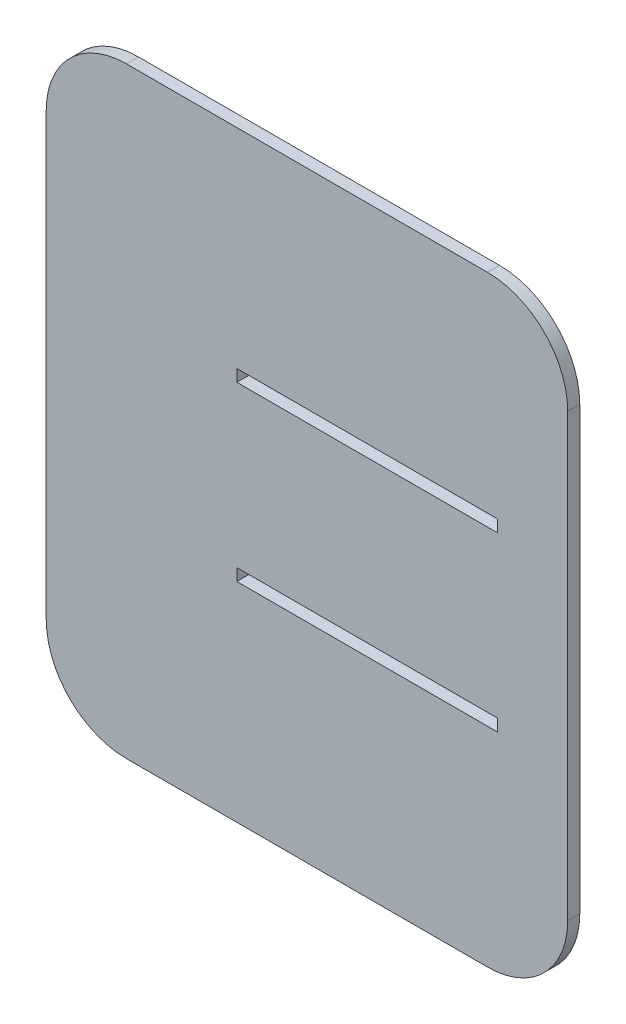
ISO-10303-21;
HEADER;
FILE_DESCRIPTION(('STEP AP214'),'2;1');
FILE_NAME('part.step','',(''),(''),'','','');
FILE_SCHEMA(('AUTOMOTIVE_DESIGN { 1 0 10303 214 1 1 1 1 }'));
ENDSEC;
DATA;
#1=APPLICATION_CONTEXT('core data for automotive mechanical design processes');
#2=APPLICATION_PROTOCOL_DEFINITION('international standard','automotive_design',2000,#1);
#3=PRODUCT_CONTEXT('',#1,'mechanical');
#4=PRODUCT('Part','Part','',(#3));
#5=PRODUCT_RELATED_PRODUCT_CATEGORY('part','',(#4));
#6=PRODUCT_DEFINITION_FORMATION('','',#4);
#7=PRODUCT_DEFINITION_CONTEXT('part definition',#1,'design');
#8=PRODUCT_DEFINITION('design','',#6,#7);
#9=PRODUCT_DEFINITION_SHAPE('','',#8);
#10=(LENGTH_UNIT() NAMED_UNIT(*) SI_UNIT(.MILLI.,.METRE.));
#11=(NAMED_UNIT(*) PLANE_ANGLE_UNIT() SI_UNIT($,.RADIAN.));
#12=(NAMED_UNIT(*) SI_UNIT($,.STERADIAN.) SOLID_ANGLE_UNIT());
#13=UNCERTAINTY_MEASURE_WITH_UNIT(LENGTH_MEASURE(1.E-05),#10,'distance_accuracy_value','');
#14=(GEOMETRIC_REPRESENTATION_CONTEXT(3) GLOBAL_UNCERTAINTY_ASSIGNED_CONTEXT((#13)) GLOBAL_UNIT_ASSIGNED_CONTEXT((#10,
#11,#12)) REPRESENTATION_CONTEXT('',''));
#15=CARTESIAN_POINT('',(0.,0.,0.));
#16=DIRECTION('',(0.,0.,1.));
#17=DIRECTION('',(1.,0.,0.));
#18=AXIS2_PLACEMENT_3D('',#15,#16,#17);
#19=CARTESIAN_POINT('',(-5.64089222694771,-41.0894941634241,3.));
#20=DIRECTION('',(0.,0.,-1.));
#21=DIRECTION('',(-1.,0.,0.));
#22=AXIS2_PLACEMENT_3D('',#19,#20,#21);
#23=PLANE('',#22);
#24=DIRECTION('',(0.,-1.,0.));
#25=VECTOR('',#24,1.);
#26=CARTESIAN_POINT('',(21.8591077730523,-6.08949416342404,3.));
#27=LINE('',#26,#25);
#28=CARTESIAN_POINT('',(21.8591077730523,-6.08949416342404,3.));
#29=VERTEX_POINT('',#28);
#30=CARTESIAN_POINT('',(21.8591077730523,-9.08949416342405,3.));
#31=VERTEX_POINT('',#30);
#32=EDGE_CURVE('E182',#29,#31,#27,.T.);
#33=ORIENTED_EDGE('',*,*,#32,.F.);
#34=DIRECTION('',(-1.,0.,0.));
#35=VECTOR('',#34,1.);
#36=CARTESIAN_POINT('',(21.8591077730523,-6.08949416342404,3.));
#37=LINE('',#36,#35);
#38=CARTESIAN_POINT('',(86.8591077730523,-6.08949416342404,3.));
#39=VERTEX_POINT('',#38);
#40=EDGE_CURVE('E190',#39,#29,#37,.T.);
#41=ORIENTED_EDGE('',*,*,#40,.F.);
#42=DIRECTION('',(0.,1.,0.));
#43=VECTOR('',#42,1.);
#44=CARTESIAN_POINT('',(86.8591077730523,-6.08949416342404,3.));
#45=LINE('',#44,#43);
#46=CARTESIAN_POINT('',(86.8591077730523,-9.08949416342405,3.));
#47=VERTEX_POINT('',#46);
#48=EDGE_CURVE('E187',#47,#39,#45,.T.);
#49=ORIENTED_EDGE('',*,*,#48,.F.);
#50=DIRECTION('',(1.,0.,0.));
#51=VECTOR('',#50,1.);
#52=CARTESIAN_POINT('',(21.8591077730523,-9.08949416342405,3.));
#53=LINE('',#52,#51);
#54=EDGE_CURVE('E184',#31,#47,#53,.T.);
#55=ORIENTED_EDGE('',*,*,#54,.F.);
#56=EDGE_LOOP('',(#33,#41,#49,#55));
#57=FACE_BOUND('',#56,.T.);
#58=CARTESIAN_POINT('',(-5.64089222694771,-41.0894941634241,3.));
#59=DIRECTION('',(0.,0.,1.));
#60=DIRECTION('',(-1.,0.,0.));
#61=AXIS2_PLACEMENT_3D('',#58,#59,#60);
#62=CIRCLE('',#61,20.);
#63=CARTESIAN_POINT('',(-25.6408922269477,-41.0894941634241,3.));
#64=VERTEX_POINT('',#63);
#65=CARTESIAN_POINT('',(-5.6408922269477,-61.0894941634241,3.));
#66=VERTEX_POINT('',#65);
#67=EDGE_CURVE('E213',#64,#66,#62,.T.);
#68=ORIENTED_EDGE('',*,*,#67,.T.);
#69=DIRECTION('',(1.,0.,0.));
#70=VECTOR('',#69,1.);
#71=CARTESIAN_POINT('',(-5.6408922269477,-61.0894941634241,3.));
#72=LINE('',#71,#70);
#73=CARTESIAN_POINT('',(84.3591077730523,-61.089494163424,3.));
#74=VERTEX_POINT('',#73);
#75=EDGE_CURVE('E216',#66,#74,#72,.T.);
#76=ORIENTED_EDGE('',*,*,#75,.T.);
#77=CARTESIAN_POINT('',(84.3591077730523,-41.089494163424,3.));
#78=DIRECTION('',(0.,0.,1.));
#79=DIRECTION('',(1.,0.,0.));
#80=AXIS2_PLACEMENT_3D('',#77,#78,#79);
#81=CIRCLE('',#80,20.);
#82=CARTESIAN_POINT('',(104.359107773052,-41.089494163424,3.));
#83=VERTEX_POINT('',#82);
#84=EDGE_CURVE('E219',#74,#83,#81,.T.);
#85=ORIENTED_EDGE('',*,*,#84,.T.);
#86=DIRECTION('',(0.,1.,0.));
#87=VECTOR('',#86,1.);
#88=CARTESIAN_POINT('',(104.359107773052,68.9105058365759,3.));
#89=LINE('',#88,#87);
#90=CARTESIAN_POINT('',(104.359107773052,68.9105058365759,3.));
#91=VERTEX_POINT('',#90);
#92=EDGE_CURVE('E221',#83,#91,#89,.T.);
#93=ORIENTED_EDGE('',*,*,#92,.T.);
#94=CARTESIAN_POINT('',(84.3591077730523,68.9105058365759,3.));
#95=DIRECTION('',(0.,0.,1.));
#96=DIRECTION('',(1.,0.,0.));
#97=AXIS2_PLACEMENT_3D('',#94,#95,#96);
#98=CIRCLE('',#97,20.);
#99=CARTESIAN_POINT('',(84.3591077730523,88.9105058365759,3.));
#100=VERTEX_POINT('',#99);
#101=EDGE_CURVE('E223',#91,#100,#98,.T.);
#102=ORIENTED_EDGE('',*,*,#101,.T.);
#103=DIRECTION('',(-1.,0.,0.));
#104=VECTOR('',#103,1.);
#105=CARTESIAN_POINT('',(-5.64089222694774,88.9105058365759,3.));
#106=LINE('',#105,#104);
#107=CARTESIAN_POINT('',(-5.64089222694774,88.9105058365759,3.));
#108=VERTEX_POINT('',#107);
#109=EDGE_CURVE('E225',#100,#108,#106,.T.);
#110=ORIENTED_EDGE('',*,*,#109,.T.);
#111=CARTESIAN_POINT('',(-5.64089222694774,68.9105058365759,3.));
#112=DIRECTION('',(0.,0.,1.));
#113=DIRECTION('',(-1.,0.,0.));
#114=AXIS2_PLACEMENT_3D('',#111,#112,#113);
#115=CIRCLE('',#114,20.);
#116=CARTESIAN_POINT('',(-25.6408922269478,68.9105058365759,3.));
#117=VERTEX_POINT('',#116);
#118=EDGE_CURVE('E227',#108,#117,#115,.T.);
#119=ORIENTED_EDGE('',*,*,#118,.T.);
#120=DIRECTION('',(0.,-1.,0.));
#121=VECTOR('',#120,1.);
#122=CARTESIAN_POINT('',(-25.6408922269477,68.9105058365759,3.));
#123=LINE('',#122,#121);
#124=EDGE_CURVE('E229',#117,#64,#123,.T.);
#125=ORIENTED_EDGE('',*,*,#124,.T.);
#126=EDGE_LOOP('',(#68,#76,#85,#93,#102,#110,#119,#125));
#127=FACE_BOUND('',#126,.T.);
#128=DIRECTION('',(1.,0.,0.));
#129=VECTOR('',#128,1.);
#130=CARTESIAN_POINT('',(21.8591077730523,33.9105058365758,3.));
#131=LINE('',#130,#129);
#132=CARTESIAN_POINT('',(21.8591077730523,33.9105058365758,3.));
#133=VERTEX_POINT('',#132);
#134=CARTESIAN_POINT('',(86.8591077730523,33.9105058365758,3.));
#135=VERTEX_POINT('',#134);
#136=EDGE_CURVE('E146',#133,#135,#131,.T.);
#137=ORIENTED_EDGE('',*,*,#136,.F.);
#138=DIRECTION('',(0.,-1.,0.));
#139=VECTOR('',#138,1.);
#140=CARTESIAN_POINT('',(21.8591077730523,33.9105058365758,3.));
#141=LINE('',#140,#139);
#142=CARTESIAN_POINT('',(21.8591077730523,36.9105058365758,3.));
#143=VERTEX_POINT('',#142);
#144=EDGE_CURVE('E168',#143,#133,#141,.T.);
#145=ORIENTED_EDGE('',*,*,#144,.F.);
#146=DIRECTION('',(-1.,0.,0.));
#147=VECTOR('',#146,1.);
#148=CARTESIAN_POINT('',(21.8591077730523,36.9105058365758,3.));
#149=LINE('',#148,#147);
#150=CARTESIAN_POINT('',(86.8591077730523,36.9105058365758,3.));
#151=VERTEX_POINT('',#150);
#152=EDGE_CURVE('E166',#151,#143,#149,.T.);
#153=ORIENTED_EDGE('',*,*,#152,.F.);
#154=DIRECTION('',(0.,1.,0.));
#155=VECTOR('',#154,1.);
#156=CARTESIAN_POINT('',(86.8591077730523,33.9105058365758,3.));
#157=LINE('',#156,#155);
#158=EDGE_CURVE('E154',#135,#151,#157,.T.);
#159=ORIENTED_EDGE('',*,*,#158,.F.);
#160=EDGE_LOOP('',(#137,#145,#153,#159));
#161=FACE_BOUND('',#160,.T.);
#162=ADVANCED_FACE('F33',(#57,#127,#161),#23,.F.);
#163=CARTESIAN_POINT('',(-5.64089222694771,-41.0894941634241,0.));
#164=DIRECTION('',(0.,0.,-1.));
#165=DIRECTION('',(-1.,0.,0.));
#166=AXIS2_PLACEMENT_3D('',#163,#164,#165);
#167=PLANE('',#166);
#168=CARTESIAN_POINT('',(-5.64089222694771,-41.0894941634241,0.));
#169=DIRECTION('',(0.,0.,1.));
#170=DIRECTION('',(-1.,0.,0.));
#171=AXIS2_PLACEMENT_3D('',#168,#169,#170);
#172=CIRCLE('',#171,20.);
#173=CARTESIAN_POINT('',(-25.6408922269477,-41.0894941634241,0.));
#174=VERTEX_POINT('',#173);
#175=CARTESIAN_POINT('',(-5.6408922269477,-61.0894941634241,0.));
#176=VERTEX_POINT('',#175);
#177=EDGE_CURVE('E212',#174,#176,#172,.T.);
#178=ORIENTED_EDGE('',*,*,#177,.F.);
#179=DIRECTION('',(0.,-1.,0.));
#180=VECTOR('',#179,1.);
#181=CARTESIAN_POINT('',(-25.6408922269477,68.9105058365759,0.));
#182=LINE('',#181,#180);
#183=CARTESIAN_POINT('',(-25.6408922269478,68.9105058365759,0.));
#184=VERTEX_POINT('',#183);
#185=EDGE_CURVE('E217',#184,#174,#182,.T.);
#186=ORIENTED_EDGE('',*,*,#185,.F.);
#187=CARTESIAN_POINT('',(-5.64089222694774,68.9105058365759,0.));
#188=DIRECTION('',(0.,0.,1.));
#189=DIRECTION('',(-1.,0.,0.));
#190=AXIS2_PLACEMENT_3D('',#187,#188,#189);
#191=CIRCLE('',#190,20.);
#192=CARTESIAN_POINT('',(-5.64089222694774,88.9105058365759,0.));
#193=VERTEX_POINT('',#192);
#194=EDGE_CURVE('E244',#193,#184,#191,.T.);
#195=ORIENTED_EDGE('',*,*,#194,.F.);
#196=DIRECTION('',(-1.,0.,0.));
#197=VECTOR('',#196,1.);
#198=CARTESIAN_POINT('',(-5.64089222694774,88.9105058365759,0.));
#199=LINE('',#198,#197);
#200=CARTESIAN_POINT('',(84.3591077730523,88.9105058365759,0.));
#201=VERTEX_POINT('',#200);
#202=EDGE_CURVE('E242',#201,#193,#199,.T.);
#203=ORIENTED_EDGE('',*,*,#202,.F.);
#204=CARTESIAN_POINT('',(84.3591077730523,68.9105058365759,0.));
#205=DIRECTION('',(0.,0.,1.));
#206=DIRECTION('',(1.,0.,0.));
#207=AXIS2_PLACEMENT_3D('',#204,#205,#206);
#208=CIRCLE('',#207,20.);
#209=CARTESIAN_POINT('',(104.359107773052,68.9105058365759,0.));
#210=VERTEX_POINT('',#209);
#211=EDGE_CURVE('E240',#210,#201,#208,.T.);
#212=ORIENTED_EDGE('',*,*,#211,.F.);
#213=DIRECTION('',(0.,1.,0.));
#214=VECTOR('',#213,1.);
#215=CARTESIAN_POINT('',(104.359107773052,68.9105058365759,0.));
#216=LINE('',#215,#214);
#217=CARTESIAN_POINT('',(104.359107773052,-41.089494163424,0.));
#218=VERTEX_POINT('',#217);
#219=EDGE_CURVE('E238',#218,#210,#216,.T.);
#220=ORIENTED_EDGE('',*,*,#219,.F.);
#221=CARTESIAN_POINT('',(84.3591077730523,-41.089494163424,0.));
#222=DIRECTION('',(0.,0.,1.));
#223=DIRECTION('',(1.,0.,0.));
#224=AXIS2_PLACEMENT_3D('',#221,#222,#223);
#225=CIRCLE('',#224,20.);
#226=CARTESIAN_POINT('',(84.3591077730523,-61.089494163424,0.));
#227=VERTEX_POINT('',#226);
#228=EDGE_CURVE('E236',#227,#218,#225,.T.);
#229=ORIENTED_EDGE('',*,*,#228,.F.);
#230=DIRECTION('',(1.,0.,0.));
#231=VECTOR('',#230,1.);
#232=CARTESIAN_POINT('',(-5.6408922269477,-61.0894941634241,0.));
#233=LINE('',#232,#231);
#234=EDGE_CURVE('E234',#176,#227,#233,.T.);
#235=ORIENTED_EDGE('',*,*,#234,.F.);
#236=EDGE_LOOP('',(#178,#186,#195,#203,#212,#220,#229,#235));
#237=FACE_BOUND('',#236,.T.);
#238=DIRECTION('',(-1.,0.,0.));
#239=VECTOR('',#238,1.);
#240=CARTESIAN_POINT('',(21.8591077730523,-6.08949416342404,0.));
#241=LINE('',#240,#239);
#242=CARTESIAN_POINT('',(86.8591077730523,-6.08949416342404,0.));
#243=VERTEX_POINT('',#242);
#244=CARTESIAN_POINT('',(21.8591077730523,-6.08949416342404,0.));
#245=VERTEX_POINT('',#244);
#246=EDGE_CURVE('E185',#243,#245,#241,.T.);
#247=ORIENTED_EDGE('',*,*,#246,.T.);
#248=DIRECTION('',(0.,-1.,0.));
#249=VECTOR('',#248,1.);
#250=CARTESIAN_POINT('',(21.8591077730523,-6.08949416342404,0.));
#251=LINE('',#250,#249);
#252=CARTESIAN_POINT('',(21.8591077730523,-9.08949416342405,0.));
#253=VERTEX_POINT('',#252);
#254=EDGE_CURVE('E162',#245,#253,#251,.T.);
#255=ORIENTED_EDGE('',*,*,#254,.T.);
#256=DIRECTION('',(1.,0.,0.));
#257=VECTOR('',#256,1.);
#258=CARTESIAN_POINT('',(21.8591077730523,-9.08949416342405,0.));
#259=LINE('',#258,#257);
#260=CARTESIAN_POINT('',(86.8591077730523,-9.08949416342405,0.));
#261=VERTEX_POINT('',#260);
#262=EDGE_CURVE('E195',#253,#261,#259,.T.);
#263=ORIENTED_EDGE('',*,*,#262,.T.);
#264=DIRECTION('',(0.,1.,0.));
#265=VECTOR('',#264,1.);
#266=CARTESIAN_POINT('',(86.8591077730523,-6.08949416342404,0.));
#267=LINE('',#266,#265);
#268=EDGE_CURVE('E198',#261,#243,#267,.T.);
#269=ORIENTED_EDGE('',*,*,#268,.T.);
#270=EDGE_LOOP('',(#247,#255,#263,#269));
#271=FACE_BOUND('',#270,.T.);
#272=DIRECTION('',(0.,-1.,0.));
#273=VECTOR('',#272,1.);
#274=CARTESIAN_POINT('',(21.8591077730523,33.9105058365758,0.));
#275=LINE('',#274,#273);
#276=CARTESIAN_POINT('',(21.8591077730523,36.9105058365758,0.));
#277=VERTEX_POINT('',#276);
#278=CARTESIAN_POINT('',(21.8591077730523,33.9105058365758,0.));
#279=VERTEX_POINT('',#278);
#280=EDGE_CURVE('E155',#277,#279,#275,.T.);
#281=ORIENTED_EDGE('',*,*,#280,.T.);
#282=DIRECTION('',(1.,0.,0.));
#283=VECTOR('',#282,1.);
#284=CARTESIAN_POINT('',(21.8591077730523,33.9105058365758,0.));
#285=LINE('',#284,#283);
#286=CARTESIAN_POINT('',(86.8591077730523,33.9105058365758,0.));
#287=VERTEX_POINT('',#286);
#288=EDGE_CURVE('E56',#279,#287,#285,.T.);
#289=ORIENTED_EDGE('',*,*,#288,.T.);
#290=DIRECTION('',(0.,1.,0.));
#291=VECTOR('',#290,1.);
#292=CARTESIAN_POINT('',(86.8591077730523,33.9105058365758,0.));
#293=LINE('',#292,#291);
#294=CARTESIAN_POINT('',(86.8591077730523,36.9105058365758,0.));
#295=VERTEX_POINT('',#294);
#296=EDGE_CURVE('E161',#287,#295,#293,.T.);
#297=ORIENTED_EDGE('',*,*,#296,.T.);
#298=DIRECTION('',(-1.,0.,0.));
#299=VECTOR('',#298,1.);
#300=CARTESIAN_POINT('',(21.8591077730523,36.9105058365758,0.));
#301=LINE('',#300,#299);
#302=EDGE_CURVE('E174',#295,#277,#301,.T.);
#303=ORIENTED_EDGE('',*,*,#302,.T.);
#304=EDGE_LOOP('',(#281,#289,#297,#303));
#305=FACE_BOUND('',#304,.T.);
#306=ADVANCED_FACE('F274',(#237,#271,#305),#167,.T.);
#307=CARTESIAN_POINT('',(-5.64089222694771,-41.0894941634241,3.));
#308=DIRECTION('',(0.,0.,-1.));
#309=DIRECTION('',(-1.,0.,0.));
#310=AXIS2_PLACEMENT_3D('',#307,#308,#309);
#311=CYLINDRICAL_SURFACE('',#310,20.);
#312=ORIENTED_EDGE('',*,*,#177,.T.);
#313=DIRECTION('',(0.,0.,-1.));
#314=VECTOR('',#313,1.);
#315=CARTESIAN_POINT('',(-5.6408922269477,-61.0894941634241,3.));
#316=LINE('',#315,#314);
#317=EDGE_CURVE('E11',#66,#176,#316,.T.);
#318=ORIENTED_EDGE('',*,*,#317,.F.);
#319=ORIENTED_EDGE('',*,*,#67,.F.);
#320=DIRECTION('',(0.,0.,-1.));
#321=VECTOR('',#320,1.);
#322=CARTESIAN_POINT('',(-25.6408922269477,-41.0894941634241,3.));
#323=LINE('',#322,#321);
#324=EDGE_CURVE('E231',#64,#174,#323,.T.);
#325=ORIENTED_EDGE('',*,*,#324,.T.);
#326=EDGE_LOOP('',(#312,#318,#319,#325));
#327=FACE_BOUND('',#326,.T.);
#328=ADVANCED_FACE('F35',(#327),#311,.T.);
#329=CARTESIAN_POINT('',(-5.6408922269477,-61.0894941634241,3.));
#330=DIRECTION('',(0.,1.,0.));
#331=DIRECTION('',(-1.,0.,0.));
#332=AXIS2_PLACEMENT_3D('',#329,#330,#331);
#333=PLANE('',#332);
#334=ORIENTED_EDGE('',*,*,#234,.T.);
#335=DIRECTION('',(0.,0.,-1.));
#336=VECTOR('',#335,1.);
#337=CARTESIAN_POINT('',(84.3591077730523,-61.089494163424,3.));
#338=LINE('',#337,#336);
#339=EDGE_CURVE('E41',#74,#227,#338,.T.);
#340=ORIENTED_EDGE('',*,*,#339,.F.);
#341=ORIENTED_EDGE('',*,*,#75,.F.);
#342=ORIENTED_EDGE('',*,*,#317,.T.);
#343=EDGE_LOOP('',(#334,#340,#341,#342));
#344=FACE_BOUND('',#343,.T.);
#345=ADVANCED_FACE('F291',(#344),#333,.F.);
#346=CARTESIAN_POINT('',(84.3591077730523,-41.089494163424,3.));
#347=DIRECTION('',(0.,0.,-1.));
#348=DIRECTION('',(-1.,0.,0.));
#349=AXIS2_PLACEMENT_3D('',#346,#347,#348);
#350=CYLINDRICAL_SURFACE('',#349,20.);
#351=ORIENTED_EDGE('',*,*,#228,.T.);
#352=DIRECTION('',(0.,0.,-1.));
#353=VECTOR('',#352,1.);
#354=CARTESIAN_POINT('',(104.359107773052,-41.089494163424,3.));
#355=LINE('',#354,#353);
#356=EDGE_CURVE('E261',#83,#218,#355,.T.);
#357=ORIENTED_EDGE('',*,*,#356,.F.);
#358=ORIENTED_EDGE('',*,*,#84,.F.);
#359=ORIENTED_EDGE('',*,*,#339,.T.);
#360=EDGE_LOOP('',(#351,#357,#358,#359));
#361=FACE_BOUND('',#360,.T.);
#362=ADVANCED_FACE('F268',(#361),#350,.T.);
#363=CARTESIAN_POINT('',(104.359107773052,68.9105058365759,3.));
#364=DIRECTION('',(-1.,0.,0.));
#365=DIRECTION('',(0.,-1.,0.));
#366=AXIS2_PLACEMENT_3D('',#363,#364,#365);
#367=PLANE('',#366);
#368=ORIENTED_EDGE('',*,*,#219,.T.);
#369=DIRECTION('',(0.,0.,-1.));
#370=VECTOR('',#369,1.);
#371=CARTESIAN_POINT('',(104.359107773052,68.9105058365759,3.));
#372=LINE('',#371,#370);
#373=EDGE_CURVE('E258',#91,#210,#372,.T.);
#374=ORIENTED_EDGE('',*,*,#373,.F.);
#375=ORIENTED_EDGE('',*,*,#92,.F.);
#376=ORIENTED_EDGE('',*,*,#356,.T.);
#377=EDGE_LOOP('',(#368,#374,#375,#376));
#378=FACE_BOUND('',#377,.T.);
#379=ADVANCED_FACE('F280',(#378),#367,.F.);
#380=CARTESIAN_POINT('',(84.3591077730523,68.9105058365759,3.));
#381=DIRECTION('',(0.,0.,-1.));
#382=DIRECTION('',(-1.,0.,0.));
#383=AXIS2_PLACEMENT_3D('',#380,#381,#382);
#384=CYLINDRICAL_SURFACE('',#383,20.);
#385=ORIENTED_EDGE('',*,*,#211,.T.);
#386=DIRECTION('',(0.,0.,-1.));
#387=VECTOR('',#386,1.);
#388=CARTESIAN_POINT('',(84.3591077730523,88.9105058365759,3.));
#389=LINE('',#388,#387);
#390=EDGE_CURVE('E255',#100,#201,#389,.T.);
#391=ORIENTED_EDGE('',*,*,#390,.F.);
#392=ORIENTED_EDGE('',*,*,#101,.F.);
#393=ORIENTED_EDGE('',*,*,#373,.T.);
#394=EDGE_LOOP('',(#385,#391,#392,#393));
#395=FACE_BOUND('',#394,.T.);
#396=ADVANCED_FACE('F284',(#395),#384,.T.);
#397=CARTESIAN_POINT('',(-5.64089222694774,88.9105058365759,3.));
#398=DIRECTION('',(0.,-1.,0.));
#399=DIRECTION('',(0.,0.,-1.));
#400=AXIS2_PLACEMENT_3D('',#397,#398,#399);
#401=PLANE('',#400);
#402=ORIENTED_EDGE('',*,*,#202,.T.);
#403=DIRECTION('',(0.,0.,-1.));
#404=VECTOR('',#403,1.);
#405=CARTESIAN_POINT('',(-5.64089222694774,88.9105058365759,3.));
#406=LINE('',#405,#404);
#407=EDGE_CURVE('E252',#108,#193,#406,.T.);
#408=ORIENTED_EDGE('',*,*,#407,.F.);
#409=ORIENTED_EDGE('',*,*,#109,.F.);
#410=ORIENTED_EDGE('',*,*,#390,.T.);
#411=EDGE_LOOP('',(#402,#408,#409,#410));
#412=FACE_BOUND('',#411,.T.);
#413=ADVANCED_FACE('F304',(#412),#401,.F.);
#414=CARTESIAN_POINT('',(-5.64089222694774,68.9105058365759,3.));
#415=DIRECTION('',(0.,0.,-1.));
#416=DIRECTION('',(-1.,0.,0.));
#417=AXIS2_PLACEMENT_3D('',#414,#415,#416);
#418=CYLINDRICAL_SURFACE('',#417,20.);
#419=ORIENTED_EDGE('',*,*,#194,.T.);
#420=DIRECTION('',(0.,0.,-1.));
#421=VECTOR('',#420,1.);
#422=CARTESIAN_POINT('',(-25.6408922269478,68.9105058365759,3.));
#423=LINE('',#422,#421);
#424=EDGE_CURVE('E249',#117,#184,#423,.T.);
#425=ORIENTED_EDGE('',*,*,#424,.F.);
#426=ORIENTED_EDGE('',*,*,#118,.F.);
#427=ORIENTED_EDGE('',*,*,#407,.T.);
#428=EDGE_LOOP('',(#419,#425,#426,#427));
#429=FACE_BOUND('',#428,.T.);
#430=ADVANCED_FACE('F302',(#429),#418,.T.);
#431=CARTESIAN_POINT('',(-25.6408922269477,68.9105058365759,3.));
#432=DIRECTION('',(1.,0.,0.));
#433=DIRECTION('',(0.,1.,0.));
#434=AXIS2_PLACEMENT_3D('',#431,#432,#433);
#435=PLANE('',#434);
#436=ORIENTED_EDGE('',*,*,#185,.T.);
#437=ORIENTED_EDGE('',*,*,#324,.F.);
#438=ORIENTED_EDGE('',*,*,#124,.F.);
#439=ORIENTED_EDGE('',*,*,#424,.T.);
#440=EDGE_LOOP('',(#436,#437,#438,#439));
#441=FACE_BOUND('',#440,.T.);
#442=ADVANCED_FACE('F297',(#441),#435,.F.);
#443=CARTESIAN_POINT('',(21.8591077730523,-6.08949416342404,3.));
#444=DIRECTION('',(1.,0.,0.));
#445=DIRECTION('',(0.,0.,-1.));
#446=AXIS2_PLACEMENT_3D('',#443,#444,#445);
#447=PLANE('',#446);
#448=ORIENTED_EDGE('',*,*,#254,.F.);
#449=DIRECTION('',(0.,0.,-1.));
#450=VECTOR('',#449,1.);
#451=CARTESIAN_POINT('',(21.8591077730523,-6.08949416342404,3.));
#452=LINE('',#451,#450);
#453=EDGE_CURVE('E192',#29,#245,#452,.T.);
#454=ORIENTED_EDGE('',*,*,#453,.F.);
#455=ORIENTED_EDGE('',*,*,#32,.T.);
#456=DIRECTION('',(0.,0.,-1.));
#457=VECTOR('',#456,1.);
#458=CARTESIAN_POINT('',(21.8591077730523,-9.08949416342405,3.));
#459=LINE('',#458,#457);
#460=EDGE_CURVE('E209',#31,#253,#459,.T.);
#461=ORIENTED_EDGE('',*,*,#460,.T.);
#462=EDGE_LOOP('',(#448,#454,#455,#461));
#463=FACE_BOUND('',#462,.T.);
#464=ADVANCED_FACE('F322',(#463),#447,.T.);
#465=CARTESIAN_POINT('',(21.8591077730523,-9.08949416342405,3.));
#466=DIRECTION('',(0.,1.,0.));
#467=DIRECTION('',(-1.,0.,0.));
#468=AXIS2_PLACEMENT_3D('',#465,#466,#467);
#469=PLANE('',#468);
#470=ORIENTED_EDGE('',*,*,#262,.F.);
#471=ORIENTED_EDGE('',*,*,#460,.F.);
#472=ORIENTED_EDGE('',*,*,#54,.T.);
#473=DIRECTION('',(0.,0.,-1.));
#474=VECTOR('',#473,1.);
#475=CARTESIAN_POINT('',(86.8591077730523,-9.08949416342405,3.));
#476=LINE('',#475,#474);
#477=EDGE_CURVE('E207',#47,#261,#476,.T.);
#478=ORIENTED_EDGE('',*,*,#477,.T.);
#479=EDGE_LOOP('',(#470,#471,#472,#478));
#480=FACE_BOUND('',#479,.T.);
#481=ADVANCED_FACE('F329',(#480),#469,.T.);
#482=CARTESIAN_POINT('',(86.8591077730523,-6.08949416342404,3.));
#483=DIRECTION('',(-1.,0.,0.));
#484=DIRECTION('',(0.,-1.,0.));
#485=AXIS2_PLACEMENT_3D('',#482,#483,#484);
#486=PLANE('',#485);
#487=ORIENTED_EDGE('',*,*,#268,.F.);
#488=ORIENTED_EDGE('',*,*,#477,.F.);
#489=ORIENTED_EDGE('',*,*,#48,.T.);
#490=DIRECTION('',(0.,0.,-1.));
#491=VECTOR('',#490,1.);
#492=CARTESIAN_POINT('',(86.8591077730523,-6.08949416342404,3.));
#493=LINE('',#492,#491);
#494=EDGE_CURVE('E205',#39,#243,#493,.T.);
#495=ORIENTED_EDGE('',*,*,#494,.T.);
#496=EDGE_LOOP('',(#487,#488,#489,#495));
#497=FACE_BOUND('',#496,.T.);
#498=ADVANCED_FACE('F334',(#497),#486,.T.);
#499=CARTESIAN_POINT('',(21.8591077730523,-6.08949416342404,3.));
#500=DIRECTION('',(0.,-1.,0.));
#501=DIRECTION('',(0.,0.,-1.));
#502=AXIS2_PLACEMENT_3D('',#499,#500,#501);
#503=PLANE('',#502);
#504=ORIENTED_EDGE('',*,*,#246,.F.);
#505=ORIENTED_EDGE('',*,*,#494,.F.);
#506=ORIENTED_EDGE('',*,*,#40,.T.);
#507=ORIENTED_EDGE('',*,*,#453,.T.);
#508=EDGE_LOOP('',(#504,#505,#506,#507));
#509=FACE_BOUND('',#508,.T.);
#510=ADVANCED_FACE('F340',(#509),#503,.T.);
#511=CARTESIAN_POINT('',(21.8591077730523,33.9105058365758,3.));
#512=DIRECTION('',(0.,1.,0.));
#513=DIRECTION('',(0.,0.,1.));
#514=AXIS2_PLACEMENT_3D('',#511,#512,#513);
#515=PLANE('',#514);
#516=ORIENTED_EDGE('',*,*,#288,.F.);
#517=DIRECTION('',(0.,0.,-1.));
#518=VECTOR('',#517,1.);
#519=CARTESIAN_POINT('',(21.8591077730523,33.9105058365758,3.));
#520=LINE('',#519,#518);
#521=EDGE_CURVE('E150',#133,#279,#520,.T.);
#522=ORIENTED_EDGE('',*,*,#521,.F.);
#523=ORIENTED_EDGE('',*,*,#136,.T.);
#524=DIRECTION('',(0.,0.,-1.));
#525=VECTOR('',#524,1.);
#526=CARTESIAN_POINT('',(86.8591077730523,33.9105058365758,3.));
#527=LINE('',#526,#525);
#528=EDGE_CURVE('E149',#135,#287,#527,.T.);
#529=ORIENTED_EDGE('',*,*,#528,.T.);
#530=EDGE_LOOP('',(#516,#522,#523,#529));
#531=FACE_BOUND('',#530,.T.);
#532=ADVANCED_FACE('F148',(#531),#515,.T.);
#533=CARTESIAN_POINT('',(86.8591077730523,33.9105058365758,3.));
#534=DIRECTION('',(-1.,0.,0.));
#535=DIRECTION('',(0.,-1.,0.));
#536=AXIS2_PLACEMENT_3D('',#533,#534,#535);
#537=PLANE('',#536);
#538=ORIENTED_EDGE('',*,*,#296,.F.);
#539=ORIENTED_EDGE('',*,*,#528,.F.);
#540=ORIENTED_EDGE('',*,*,#158,.T.);
#541=DIRECTION('',(0.,0.,-1.));
#542=VECTOR('',#541,1.);
#543=CARTESIAN_POINT('',(86.8591077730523,36.9105058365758,3.));
#544=LINE('',#543,#542);
#545=EDGE_CURVE('E163',#151,#295,#544,.T.);
#546=ORIENTED_EDGE('',*,*,#545,.T.);
#547=EDGE_LOOP('',(#538,#539,#540,#546));
#548=FACE_BOUND('',#547,.T.);
#549=ADVANCED_FACE('F158',(#548),#537,.T.);
#550=CARTESIAN_POINT('',(21.8591077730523,36.9105058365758,3.));
#551=DIRECTION('',(0.,-1.,0.));
#552=DIRECTION('',(1.,0.,0.));
#553=AXIS2_PLACEMENT_3D('',#550,#551,#552);
#554=PLANE('',#553);
#555=ORIENTED_EDGE('',*,*,#302,.F.);
#556=ORIENTED_EDGE('',*,*,#545,.F.);
#557=ORIENTED_EDGE('',*,*,#152,.T.);
#558=DIRECTION('',(0.,0.,-1.));
#559=VECTOR('',#558,1.);
#560=CARTESIAN_POINT('',(21.8591077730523,36.9105058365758,3.));
#561=LINE('',#560,#559);
#562=EDGE_CURVE('E48',#143,#277,#561,.T.);
#563=ORIENTED_EDGE('',*,*,#562,.T.);
#564=EDGE_LOOP('',(#555,#556,#557,#563));
#565=FACE_BOUND('',#564,.T.);
#566=ADVANCED_FACE('F359',(#565),#554,.T.);
#567=CARTESIAN_POINT('',(21.8591077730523,33.9105058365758,3.));
#568=DIRECTION('',(1.,0.,0.));
#569=DIRECTION('',(0.,0.,-1.));
#570=AXIS2_PLACEMENT_3D('',#567,#568,#569);
#571=PLANE('',#570);
#572=ORIENTED_EDGE('',*,*,#280,.F.);
#573=ORIENTED_EDGE('',*,*,#562,.F.);
#574=ORIENTED_EDGE('',*,*,#144,.T.);
#575=ORIENTED_EDGE('',*,*,#521,.T.);
#576=EDGE_LOOP('',(#572,#573,#574,#575));
#577=FACE_BOUND('',#576,.T.);
#578=ADVANCED_FACE('F362',(#577),#571,.T.);
#579=CLOSED_SHELL('',(#162,#306,#328,#345,#362,#379,#396,#413,#430,#442,#464,#481,#498,#510,
#532,#549,#566,#578));
#580=MANIFOLD_SOLID_BREP('B2',#579);
#581=ADVANCED_BREP_SHAPE_REPRESENTATION('',(#18,#580),#14);
#582=SHAPE_DEFINITION_REPRESENTATION(#9,#581);
ENDSEC;
END-ISO-10303-21;
